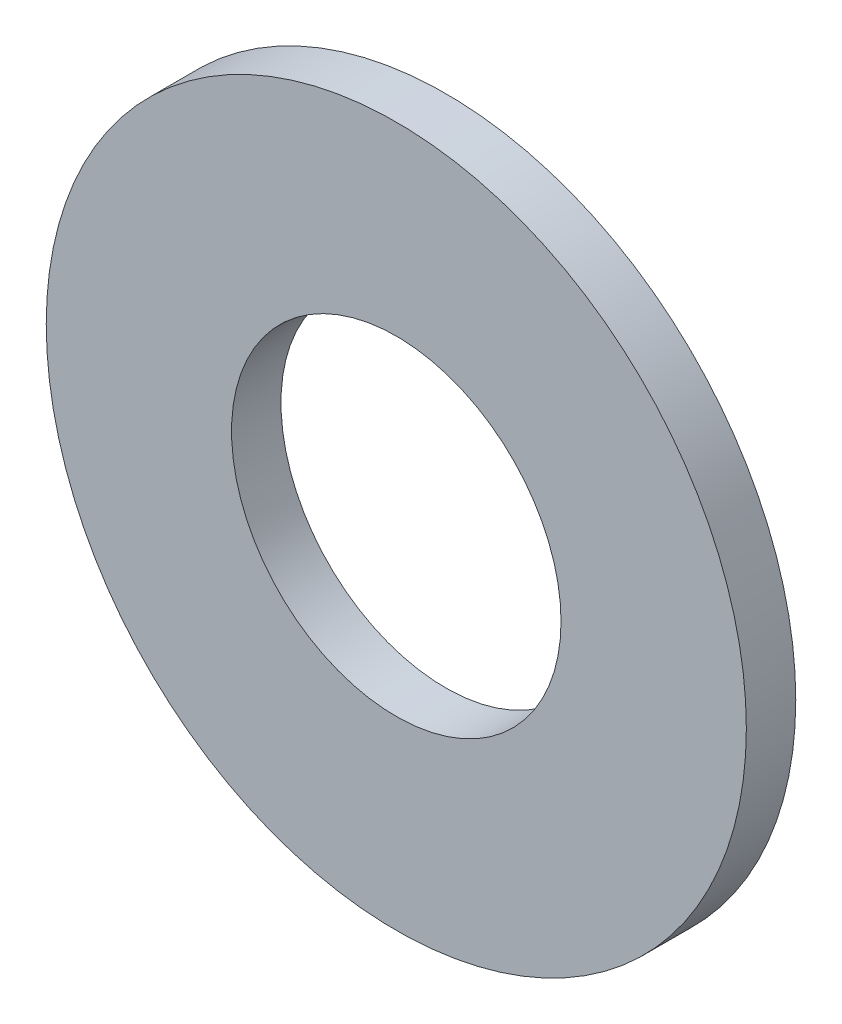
from build123d import *

# Parameters (mm, degrees)
SKETCH1_R           = 8.5
SKETCH1_R_2         = 4
BOSS_EXTRUDE1_DEPTH = 1.2


with BuildPart() as part:
    # Sketch1 → Boss-Extrude1 (new body)
    with BuildSketch(Plane.XY):
        Circle(SKETCH1_R)
        Circle(SKETCH1_R_2, mode=Mode.SUBTRACT)
    extrude(amount=BOSS_EXTRUDE1_DEPTH)


solid = part.part
